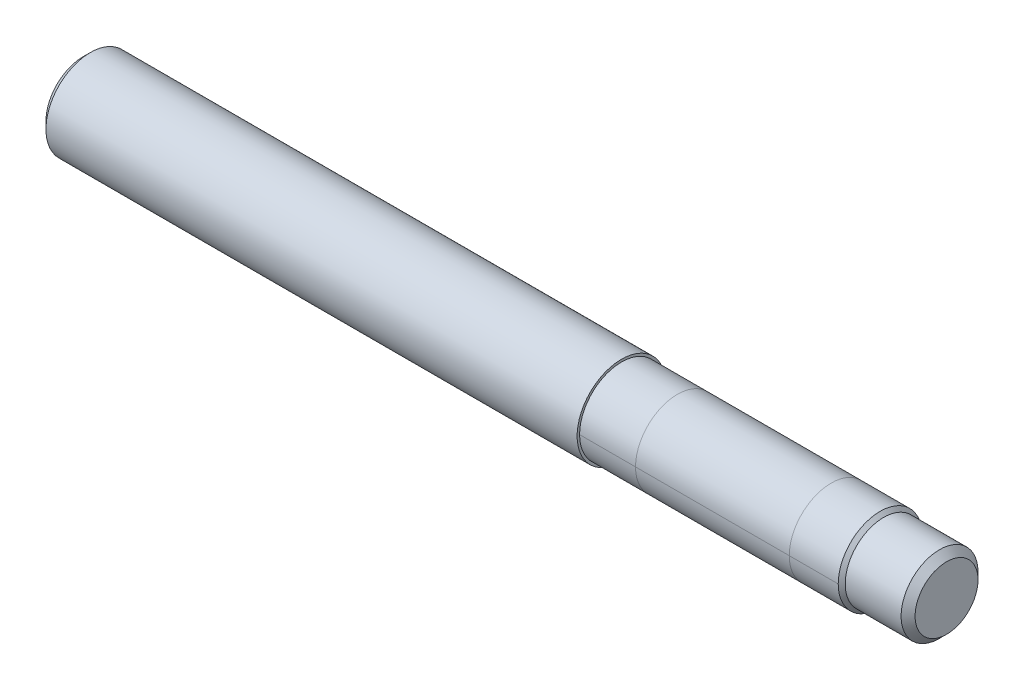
from build123d import *

# Parameters (mm, degrees)
SKETCH1_R          = 6.35
EXTRUDE1_DEPTH     = 123.5
SKETCH2_OUTSIDE_W  = 39.66
SKETCH2_OUTSIDE_H  = 39.66
SKETCH2_OUTSIDE_R  = 6
CUT_EXTRUDE1_DEPTH = 46.5
CHAMFER1_SIZE      = 1


with BuildPart() as part:
    # Sketch1 → Extrude1 (new body)
    with BuildSketch(Plane(origin=(0, 0, 0), x_dir=(0, 0, -1), z_dir=(1, 0, 0))):
        Circle(SKETCH1_R)
    extrude(amount=EXTRUDE1_DEPTH)

    # Sketch2 outside → Cut-Extrude1 (cut)
    with BuildSketch(Plane(origin=(123.5, 0, 0), x_dir=(0, 0, -1), z_dir=(1, 0, 0))):
        Rectangle(SKETCH2_OUTSIDE_W, SKETCH2_OUTSIDE_H)
        Circle(SKETCH2_OUTSIDE_R, mode=Mode.SUBTRACT)
    extrude(amount=-CUT_EXTRUDE1_DEPTH, mode=Mode.SUBTRACT)

    # Sketch3 → Cut-Revolve1 (revolve, cut)
    with BuildSketch(Plane.XY, mode=Mode.PRIVATE) as cut_revolve1_sk:
        Polygon((123.5, 10.253952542), (123.5, 5.5), (114.5, 5.5), (112.600148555, 7.399851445), (112.600148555, 10.253952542), align=None)
    revolve(cut_revolve1_sk.sketch.rotate(Axis((127.965017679, 0, 0), (-1, 0, 0)), 90), axis=Axis((127.965017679, 0, 0), (-1, 0, 0)), mode=Mode.SUBTRACT)

    # Chamfer1
    chamfer1_edges = [part.edges().sort_by_distance(p)[0] for p in [
        (0, 0, 6.35),
        (123.5, 0, 5.5),
    ]]
    chamfer(chamfer1_edges, length=CHAMFER1_SIZE)


solid = part.part
